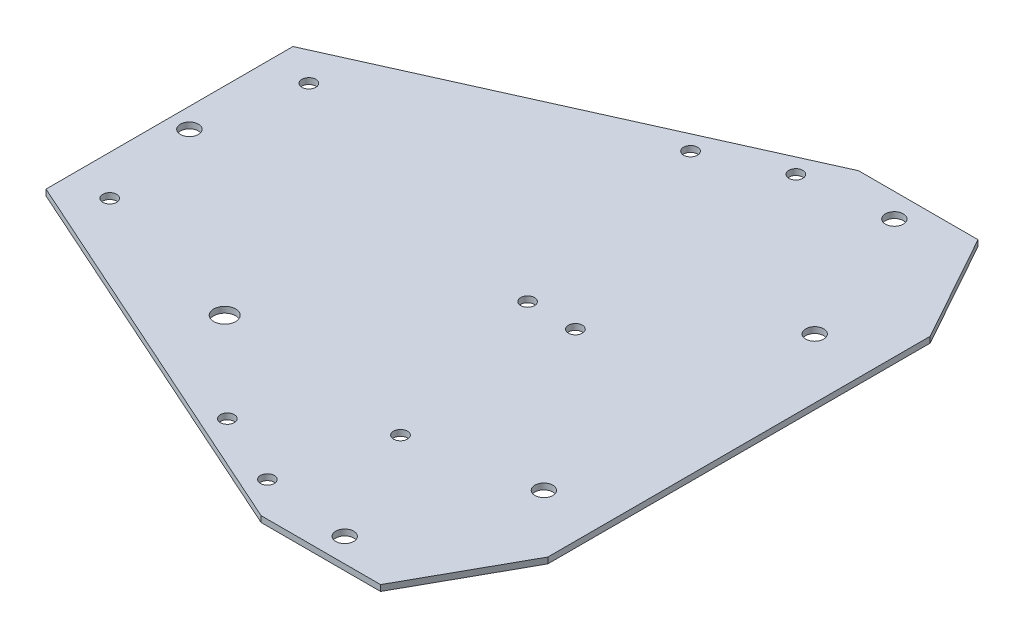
ISO-10303-21;
HEADER;
FILE_DESCRIPTION(('STEP AP214'),'2;1');
FILE_NAME('part.step','',(''),(''),'','','');
FILE_SCHEMA(('AUTOMOTIVE_DESIGN { 1 0 10303 214 1 1 1 1 }'));
ENDSEC;
DATA;
#1=APPLICATION_CONTEXT('core data for automotive mechanical design processes');
#2=APPLICATION_PROTOCOL_DEFINITION('international standard','automotive_design',2000,#1);
#3=PRODUCT_CONTEXT('',#1,'mechanical');
#4=PRODUCT('Part','Part','',(#3));
#5=PRODUCT_RELATED_PRODUCT_CATEGORY('part','',(#4));
#6=PRODUCT_DEFINITION_FORMATION('','',#4);
#7=PRODUCT_DEFINITION_CONTEXT('part definition',#1,'design');
#8=PRODUCT_DEFINITION('design','',#6,#7);
#9=PRODUCT_DEFINITION_SHAPE('','',#8);
#10=(LENGTH_UNIT() NAMED_UNIT(*) SI_UNIT(.MILLI.,.METRE.));
#11=(NAMED_UNIT(*) PLANE_ANGLE_UNIT() SI_UNIT($,.RADIAN.));
#12=(NAMED_UNIT(*) SI_UNIT($,.STERADIAN.) SOLID_ANGLE_UNIT());
#13=UNCERTAINTY_MEASURE_WITH_UNIT(LENGTH_MEASURE(1.E-05),#10,'distance_accuracy_value','');
#14=(GEOMETRIC_REPRESENTATION_CONTEXT(3) GLOBAL_UNCERTAINTY_ASSIGNED_CONTEXT((#13)) GLOBAL_UNIT_ASSIGNED_CONTEXT((#10,
#11,#12)) REPRESENTATION_CONTEXT('',''));
#15=CARTESIAN_POINT('',(0.,0.,0.));
#16=DIRECTION('',(0.,0.,1.));
#17=DIRECTION('',(1.,0.,0.));
#18=AXIS2_PLACEMENT_3D('',#15,#16,#17);
#19=CARTESIAN_POINT('',(0.,-1.5,-31.));
#20=DIRECTION('',(-0.40959040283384,0.,-0.912269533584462));
#21=DIRECTION('',(-0.912269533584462,0.,0.40959040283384));
#22=AXIS2_PLACEMENT_3D('',#19,#20,#21);
#23=PLANE('',#22);
#24=DIRECTION('',(-0.912269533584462,0.,0.40959040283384));
#25=VECTOR('',#24,1.);
#26=CARTESIAN_POINT('',(0.,0.,-31.));
#27=LINE('',#26,#25);
#28=CARTESIAN_POINT('',(98.,0.,-75.));
#29=VERTEX_POINT('',#28);
#30=CARTESIAN_POINT('',(0.,0.,-31.));
#31=VERTEX_POINT('',#30);
#32=EDGE_CURVE('E150',#29,#31,#27,.T.);
#33=ORIENTED_EDGE('',*,*,#32,.F.);
#34=DIRECTION('',(0.,1.,0.));
#35=VECTOR('',#34,1.);
#36=CARTESIAN_POINT('',(98.,-1.5,-75.));
#37=LINE('',#36,#35);
#38=CARTESIAN_POINT('',(98.,-1.5,-75.));
#39=VERTEX_POINT('',#38);
#40=EDGE_CURVE('E13',#39,#29,#37,.T.);
#41=ORIENTED_EDGE('',*,*,#40,.F.);
#42=DIRECTION('',(-0.912269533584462,0.,0.40959040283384));
#43=VECTOR('',#42,1.);
#44=CARTESIAN_POINT('',(0.,-1.5,-31.));
#45=LINE('',#44,#43);
#46=CARTESIAN_POINT('',(0.,-1.5,-31.));
#47=VERTEX_POINT('',#46);
#48=EDGE_CURVE('E171',#39,#47,#45,.T.);
#49=ORIENTED_EDGE('',*,*,#48,.T.);
#50=DIRECTION('',(0.,1.,0.));
#51=VECTOR('',#50,1.);
#52=CARTESIAN_POINT('',(0.,-1.5,-31.));
#53=LINE('',#52,#51);
#54=EDGE_CURVE('E56',#47,#31,#53,.T.);
#55=ORIENTED_EDGE('',*,*,#54,.T.);
#56=EDGE_LOOP('',(#33,#41,#49,#55));
#57=FACE_BOUND('',#56,.T.);
#58=ADVANCED_FACE('F53',(#57),#23,.T.);
#59=CARTESIAN_POINT('',(98.,-1.5,-75.));
#60=DIRECTION('',(0.,0.,-1.));
#61=DIRECTION('',(-1.,0.,0.));
#62=AXIS2_PLACEMENT_3D('',#59,#60,#61);
#63=PLANE('',#62);
#64=DIRECTION('',(-1.,0.,0.));
#65=VECTOR('',#64,1.);
#66=CARTESIAN_POINT('',(98.,0.,-75.));
#67=LINE('',#66,#65);
#68=CARTESIAN_POINT('',(128.,0.,-75.));
#69=VERTEX_POINT('',#68);
#70=EDGE_CURVE('E169',#69,#29,#67,.T.);
#71=ORIENTED_EDGE('',*,*,#70,.F.);
#72=DIRECTION('',(0.,1.,0.));
#73=VECTOR('',#72,1.);
#74=CARTESIAN_POINT('',(128.,-1.5,-75.));
#75=LINE('',#74,#73);
#76=CARTESIAN_POINT('',(128.,-1.5,-75.));
#77=VERTEX_POINT('',#76);
#78=EDGE_CURVE('E62',#77,#69,#75,.T.);
#79=ORIENTED_EDGE('',*,*,#78,.F.);
#80=DIRECTION('',(-1.,0.,0.));
#81=VECTOR('',#80,1.);
#82=CARTESIAN_POINT('',(98.,-1.5,-75.));
#83=LINE('',#82,#81);
#84=EDGE_CURVE('E140',#77,#39,#83,.T.);
#85=ORIENTED_EDGE('',*,*,#84,.T.);
#86=ORIENTED_EDGE('',*,*,#40,.T.);
#87=EDGE_LOOP('',(#71,#79,#85,#86));
#88=FACE_BOUND('',#87,.T.);
#89=ADVANCED_FACE('F183',(#88),#63,.T.);
#90=CARTESIAN_POINT('',(128.,-1.5,-75.));
#91=DIRECTION('',(0.874157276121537,0.,-0.485642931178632));
#92=DIRECTION('',(-0.485642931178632,0.,-0.874157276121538));
#93=AXIS2_PLACEMENT_3D('',#90,#91,#92);
#94=PLANE('',#93);
#95=DIRECTION('',(-0.485642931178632,0.,-0.874157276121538));
#96=VECTOR('',#95,1.);
#97=CARTESIAN_POINT('',(128.,0.,-75.));
#98=LINE('',#97,#96);
#99=CARTESIAN_POINT('',(143.,0.,-48.));
#100=VERTEX_POINT('',#99);
#101=EDGE_CURVE('E127',#100,#69,#98,.T.);
#102=ORIENTED_EDGE('',*,*,#101,.F.);
#103=DIRECTION('',(0.,1.,0.));
#104=VECTOR('',#103,1.);
#105=CARTESIAN_POINT('',(143.,-1.5,-48.));
#106=LINE('',#105,#104);
#107=CARTESIAN_POINT('',(143.,-1.5,-48.));
#108=VERTEX_POINT('',#107);
#109=EDGE_CURVE('E122',#108,#100,#106,.T.);
#110=ORIENTED_EDGE('',*,*,#109,.F.);
#111=DIRECTION('',(-0.485642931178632,0.,-0.874157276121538));
#112=VECTOR('',#111,1.);
#113=CARTESIAN_POINT('',(128.,-1.5,-75.));
#114=LINE('',#113,#112);
#115=EDGE_CURVE('E125',#108,#77,#114,.T.);
#116=ORIENTED_EDGE('',*,*,#115,.T.);
#117=ORIENTED_EDGE('',*,*,#78,.T.);
#118=EDGE_LOOP('',(#102,#110,#116,#117));
#119=FACE_BOUND('',#118,.T.);
#120=ADVANCED_FACE('F124',(#119),#94,.T.);
#121=CARTESIAN_POINT('',(143.,-1.5,-48.));
#122=DIRECTION('',(1.,0.,0.));
#123=DIRECTION('',(0.,0.,-1.));
#124=AXIS2_PLACEMENT_3D('',#121,#122,#123);
#125=PLANE('',#124);
#126=DIRECTION('',(0.,0.,-1.));
#127=VECTOR('',#126,1.);
#128=CARTESIAN_POINT('',(143.,0.,-48.));
#129=LINE('',#128,#127);
#130=CARTESIAN_POINT('',(143.,0.,48.));
#131=VERTEX_POINT('',#130);
#132=EDGE_CURVE('E166',#131,#100,#129,.T.);
#133=ORIENTED_EDGE('',*,*,#132,.F.);
#134=DIRECTION('',(0.,1.,0.));
#135=VECTOR('',#134,1.);
#136=CARTESIAN_POINT('',(143.,-1.5,48.));
#137=LINE('',#136,#135);
#138=CARTESIAN_POINT('',(143.,-1.5,48.));
#139=VERTEX_POINT('',#138);
#140=EDGE_CURVE('E132',#139,#131,#137,.T.);
#141=ORIENTED_EDGE('',*,*,#140,.F.);
#142=DIRECTION('',(0.,0.,-1.));
#143=VECTOR('',#142,1.);
#144=CARTESIAN_POINT('',(143.,-1.5,-48.));
#145=LINE('',#144,#143);
#146=EDGE_CURVE('E138',#139,#108,#145,.T.);
#147=ORIENTED_EDGE('',*,*,#146,.T.);
#148=ORIENTED_EDGE('',*,*,#109,.T.);
#149=EDGE_LOOP('',(#133,#141,#147,#148));
#150=FACE_BOUND('',#149,.T.);
#151=ADVANCED_FACE('F142',(#150),#125,.T.);
#152=CARTESIAN_POINT('',(128.,-1.5,75.));
#153=DIRECTION('',(0.874157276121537,0.,0.485642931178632));
#154=DIRECTION('',(0.485642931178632,0.,-0.874157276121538));
#155=AXIS2_PLACEMENT_3D('',#152,#153,#154);
#156=PLANE('',#155);
#157=DIRECTION('',(0.485642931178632,0.,-0.874157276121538));
#158=VECTOR('',#157,1.);
#159=CARTESIAN_POINT('',(128.,0.,75.));
#160=LINE('',#159,#158);
#161=CARTESIAN_POINT('',(128.,0.,75.));
#162=VERTEX_POINT('',#161);
#163=EDGE_CURVE('E163',#162,#131,#160,.T.);
#164=ORIENTED_EDGE('',*,*,#163,.F.);
#165=DIRECTION('',(0.,1.,0.));
#166=VECTOR('',#165,1.);
#167=CARTESIAN_POINT('',(128.,-1.5,75.));
#168=LINE('',#167,#166);
#169=CARTESIAN_POINT('',(128.,-1.5,75.));
#170=VERTEX_POINT('',#169);
#171=EDGE_CURVE('E175',#170,#162,#168,.T.);
#172=ORIENTED_EDGE('',*,*,#171,.F.);
#173=DIRECTION('',(0.485642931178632,0.,-0.874157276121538));
#174=VECTOR('',#173,1.);
#175=CARTESIAN_POINT('',(128.,-1.5,75.));
#176=LINE('',#175,#174);
#177=EDGE_CURVE('E143',#170,#139,#176,.T.);
#178=ORIENTED_EDGE('',*,*,#177,.T.);
#179=ORIENTED_EDGE('',*,*,#140,.T.);
#180=EDGE_LOOP('',(#164,#172,#178,#179));
#181=FACE_BOUND('',#180,.T.);
#182=ADVANCED_FACE('F196',(#181),#156,.T.);
#183=CARTESIAN_POINT('',(98.,-1.5,75.));
#184=DIRECTION('',(0.,0.,1.));
#185=DIRECTION('',(1.,0.,0.));
#186=AXIS2_PLACEMENT_3D('',#183,#184,#185);
#187=PLANE('',#186);
#188=DIRECTION('',(1.,0.,0.));
#189=VECTOR('',#188,1.);
#190=CARTESIAN_POINT('',(98.,0.,75.));
#191=LINE('',#190,#189);
#192=CARTESIAN_POINT('',(98.,0.,75.));
#193=VERTEX_POINT('',#192);
#194=EDGE_CURVE('E160',#193,#162,#191,.T.);
#195=ORIENTED_EDGE('',*,*,#194,.F.);
#196=DIRECTION('',(0.,1.,0.));
#197=VECTOR('',#196,1.);
#198=CARTESIAN_POINT('',(98.,-1.5,75.));
#199=LINE('',#198,#197);
#200=CARTESIAN_POINT('',(98.,-1.5,75.));
#201=VERTEX_POINT('',#200);
#202=EDGE_CURVE('E177',#201,#193,#199,.T.);
#203=ORIENTED_EDGE('',*,*,#202,.F.);
#204=DIRECTION('',(1.,0.,0.));
#205=VECTOR('',#204,1.);
#206=CARTESIAN_POINT('',(98.,-1.5,75.));
#207=LINE('',#206,#205);
#208=EDGE_CURVE('E145',#201,#170,#207,.T.);
#209=ORIENTED_EDGE('',*,*,#208,.T.);
#210=ORIENTED_EDGE('',*,*,#171,.T.);
#211=EDGE_LOOP('',(#195,#203,#209,#210));
#212=FACE_BOUND('',#211,.T.);
#213=ADVANCED_FACE('F199',(#212),#187,.T.);
#214=CARTESIAN_POINT('',(0.,-1.5,31.));
#215=DIRECTION('',(-0.40959040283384,0.,0.912269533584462));
#216=DIRECTION('',(0.912269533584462,0.,0.40959040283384));
#217=AXIS2_PLACEMENT_3D('',#214,#215,#216);
#218=PLANE('',#217);
#219=DIRECTION('',(0.912269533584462,0.,0.40959040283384));
#220=VECTOR('',#219,1.);
#221=CARTESIAN_POINT('',(0.,0.,31.));
#222=LINE('',#221,#220);
#223=CARTESIAN_POINT('',(0.,0.,31.));
#224=VERTEX_POINT('',#223);
#225=EDGE_CURVE('E157',#224,#193,#222,.T.);
#226=ORIENTED_EDGE('',*,*,#225,.F.);
#227=DIRECTION('',(0.,1.,0.));
#228=VECTOR('',#227,1.);
#229=CARTESIAN_POINT('',(0.,-1.5,31.));
#230=LINE('',#229,#228);
#231=CARTESIAN_POINT('',(0.,-1.5,31.));
#232=VERTEX_POINT('',#231);
#233=EDGE_CURVE('E178',#232,#224,#230,.T.);
#234=ORIENTED_EDGE('',*,*,#233,.F.);
#235=DIRECTION('',(0.912269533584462,0.,0.40959040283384));
#236=VECTOR('',#235,1.);
#237=CARTESIAN_POINT('',(0.,-1.5,31.));
#238=LINE('',#237,#236);
#239=EDGE_CURVE('E375',#232,#201,#238,.T.);
#240=ORIENTED_EDGE('',*,*,#239,.T.);
#241=ORIENTED_EDGE('',*,*,#202,.T.);
#242=EDGE_LOOP('',(#226,#234,#240,#241));
#243=FACE_BOUND('',#242,.T.);
#244=ADVANCED_FACE('F203',(#243),#218,.T.);
#245=CARTESIAN_POINT('',(0.,-1.5,31.));
#246=DIRECTION('',(-1.,0.,0.));
#247=DIRECTION('',(0.,0.,1.));
#248=AXIS2_PLACEMENT_3D('',#245,#246,#247);
#249=PLANE('',#248);
#250=DIRECTION('',(0.,0.,1.));
#251=VECTOR('',#250,1.);
#252=CARTESIAN_POINT('',(0.,0.,31.));
#253=LINE('',#252,#251);
#254=EDGE_CURVE('E153',#31,#224,#253,.T.);
#255=ORIENTED_EDGE('',*,*,#254,.F.);
#256=ORIENTED_EDGE('',*,*,#54,.F.);
#257=DIRECTION('',(0.,0.,1.));
#258=VECTOR('',#257,1.);
#259=CARTESIAN_POINT('',(0.,-1.5,31.));
#260=LINE('',#259,#258);
#261=EDGE_CURVE('E373',#47,#232,#260,.T.);
#262=ORIENTED_EDGE('',*,*,#261,.T.);
#263=ORIENTED_EDGE('',*,*,#233,.T.);
#264=EDGE_LOOP('',(#255,#256,#262,#263));
#265=FACE_BOUND('',#264,.T.);
#266=ADVANCED_FACE('F180',(#265),#249,.T.);
#267=CARTESIAN_POINT('',(0.,-1.5,0.));
#268=DIRECTION('',(0.,-1.,0.));
#269=DIRECTION('',(0.,0.,-1.));
#270=AXIS2_PLACEMENT_3D('',#267,#268,#269);
#271=PLANE('',#270);
#272=CARTESIAN_POINT('',(96.92,-1.5,-5.));
#273=DIRECTION('',(0.,1.,0.));
#274=DIRECTION('',(0.,0.,1.));
#275=AXIS2_PLACEMENT_3D('',#272,#273,#274);
#276=CIRCLE('',#275,1.75);
#277=CARTESIAN_POINT('',(96.92,-1.5,-3.25));
#278=VERTEX_POINT('',#277);
#279=EDGE_CURVE('E282',#278,#278,#276,.T.);
#280=ORIENTED_EDGE('',*,*,#279,.T.);
#281=EDGE_LOOP('',(#280));
#282=FACE_BOUND('',#281,.T.);
#283=CARTESIAN_POINT('',(84.92,-1.5,-5.));
#284=DIRECTION('',(0.,1.,0.));
#285=DIRECTION('',(0.,0.,1.));
#286=AXIS2_PLACEMENT_3D('',#283,#284,#285);
#287=CIRCLE('',#286,1.75);
#288=CARTESIAN_POINT('',(84.92,-1.5,-3.25));
#289=VERTEX_POINT('',#288);
#290=EDGE_CURVE('E290',#289,#289,#287,.T.);
#291=ORIENTED_EDGE('',*,*,#290,.T.);
#292=EDGE_LOOP('',(#291));
#293=FACE_BOUND('',#292,.T.);
#294=CARTESIAN_POINT('',(98.,-1.5,40.));
#295=DIRECTION('',(0.,1.,0.));
#296=DIRECTION('',(0.,0.,1.));
#297=AXIS2_PLACEMENT_3D('',#294,#295,#296);
#298=CIRCLE('',#297,1.75);
#299=CARTESIAN_POINT('',(98.,-1.5,41.75));
#300=VERTEX_POINT('',#299);
#301=EDGE_CURVE('E296',#300,#300,#298,.T.);
#302=ORIENTED_EDGE('',*,*,#301,.T.);
#303=EDGE_LOOP('',(#302));
#304=FACE_BOUND('',#303,.T.);
#305=CARTESIAN_POINT('',(49.8636363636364,-1.5,36.));
#306=DIRECTION('',(0.,1.,0.));
#307=DIRECTION('',(0.,0.,1.));
#308=AXIS2_PLACEMENT_3D('',#305,#306,#307);
#309=CIRCLE('',#308,2.75);
#310=CARTESIAN_POINT('',(49.8636363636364,-1.5,38.75));
#311=VERTEX_POINT('',#310);
#312=EDGE_CURVE('E302',#311,#311,#309,.T.);
#313=ORIENTED_EDGE('',*,*,#312,.T.);
#314=EDGE_LOOP('',(#313));
#315=FACE_BOUND('',#314,.T.);
#316=CARTESIAN_POINT('',(10.,-1.5,25.));
#317=DIRECTION('',(0.,1.,0.));
#318=DIRECTION('',(0.,0.,-1.));
#319=AXIS2_PLACEMENT_3D('',#316,#317,#318);
#320=CIRCLE('',#319,1.75);
#321=CARTESIAN_POINT('',(10.,-1.5,23.25));
#322=VERTEX_POINT('',#321);
#323=EDGE_CURVE('E308',#322,#322,#320,.T.);
#324=ORIENTED_EDGE('',*,*,#323,.T.);
#325=EDGE_LOOP('',(#324));
#326=FACE_BOUND('',#325,.T.);
#327=CARTESIAN_POINT('',(128.,-1.5,34.));
#328=DIRECTION('',(0.,1.,0.));
#329=DIRECTION('',(0.,0.,-1.));
#330=AXIS2_PLACEMENT_3D('',#327,#328,#329);
#331=CIRCLE('',#330,2.25000000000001);
#332=CARTESIAN_POINT('',(128.,-1.5,31.75));
#333=VERTEX_POINT('',#332);
#334=EDGE_CURVE('E314',#333,#333,#331,.T.);
#335=ORIENTED_EDGE('',*,*,#334,.T.);
#336=EDGE_LOOP('',(#335));
#337=FACE_BOUND('',#336,.T.);
#338=CARTESIAN_POINT('',(113.,-1.5,69.));
#339=DIRECTION('',(0.,1.,0.));
#340=DIRECTION('',(0.,0.,-1.));
#341=AXIS2_PLACEMENT_3D('',#338,#339,#340);
#342=CIRCLE('',#341,2.25);
#343=CARTESIAN_POINT('',(113.,-1.5,66.75));
#344=VERTEX_POINT('',#343);
#345=EDGE_CURVE('E320',#344,#344,#342,.T.);
#346=ORIENTED_EDGE('',*,*,#345,.T.);
#347=EDGE_LOOP('',(#346));
#348=FACE_BOUND('',#347,.T.);
#349=CARTESIAN_POINT('',(90.9252566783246,-1.5,66.3427483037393));
#350=DIRECTION('',(0.,1.,0.));
#351=DIRECTION('',(0.,0.,-1.));
#352=AXIS2_PLACEMENT_3D('',#349,#350,#351);
#353=CIRCLE('',#352,1.75);
#354=CARTESIAN_POINT('',(90.9252566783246,-1.5,64.5927483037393));
#355=VERTEX_POINT('',#354);
#356=EDGE_CURVE('E326',#355,#355,#353,.T.);
#357=ORIENTED_EDGE('',*,*,#356,.T.);
#358=EDGE_LOOP('',(#357));
#359=FACE_BOUND('',#358,.T.);
#360=CARTESIAN_POINT('',(72.6798660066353,-1.5,58.1509402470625));
#361=DIRECTION('',(0.,1.,0.));
#362=DIRECTION('',(0.,0.,-1.));
#363=AXIS2_PLACEMENT_3D('',#360,#361,#362);
#364=CIRCLE('',#363,1.75);
#365=CARTESIAN_POINT('',(72.6798660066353,-1.5,56.4009402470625));
#366=VERTEX_POINT('',#365);
#367=EDGE_CURVE('E332',#366,#366,#364,.T.);
#368=ORIENTED_EDGE('',*,*,#367,.T.);
#369=EDGE_LOOP('',(#368));
#370=FACE_BOUND('',#369,.T.);
#371=CARTESIAN_POINT('',(90.9252566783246,-1.5,-66.3427483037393));
#372=DIRECTION('',(0.,1.,0.));
#373=DIRECTION('',(0.,0.,1.));
#374=AXIS2_PLACEMENT_3D('',#371,#372,#373);
#375=CIRCLE('',#374,1.75);
#376=CARTESIAN_POINT('',(90.9252566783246,-1.5,-64.5927483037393));
#377=VERTEX_POINT('',#376);
#378=EDGE_CURVE('E338',#377,#377,#375,.T.);
#379=ORIENTED_EDGE('',*,*,#378,.T.);
#380=EDGE_LOOP('',(#379));
#381=FACE_BOUND('',#380,.T.);
#382=CARTESIAN_POINT('',(72.6798660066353,-1.5,-58.1509402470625));
#383=DIRECTION('',(0.,1.,0.));
#384=DIRECTION('',(0.,0.,1.));
#385=AXIS2_PLACEMENT_3D('',#382,#383,#384);
#386=CIRCLE('',#385,1.75);
#387=CARTESIAN_POINT('',(72.6798660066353,-1.5,-56.4009402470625));
#388=VERTEX_POINT('',#387);
#389=EDGE_CURVE('E344',#388,#388,#386,.T.);
#390=ORIENTED_EDGE('',*,*,#389,.T.);
#391=EDGE_LOOP('',(#390));
#392=FACE_BOUND('',#391,.T.);
#393=CARTESIAN_POINT('',(128.,-1.5,-34.));
#394=DIRECTION('',(0.,1.,0.));
#395=DIRECTION('',(0.,0.,1.));
#396=AXIS2_PLACEMENT_3D('',#393,#394,#395);
#397=CIRCLE('',#396,2.25000000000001);
#398=CARTESIAN_POINT('',(128.,-1.5,-31.75));
#399=VERTEX_POINT('',#398);
#400=EDGE_CURVE('E350',#399,#399,#397,.T.);
#401=ORIENTED_EDGE('',*,*,#400,.T.);
#402=EDGE_LOOP('',(#401));
#403=FACE_BOUND('',#402,.T.);
#404=CARTESIAN_POINT('',(113.,-1.5,-69.));
#405=DIRECTION('',(0.,1.,0.));
#406=DIRECTION('',(0.,0.,1.));
#407=AXIS2_PLACEMENT_3D('',#404,#405,#406);
#408=CIRCLE('',#407,2.25);
#409=CARTESIAN_POINT('',(113.,-1.5,-66.75));
#410=VERTEX_POINT('',#409);
#411=EDGE_CURVE('E356',#410,#410,#408,.T.);
#412=ORIENTED_EDGE('',*,*,#411,.T.);
#413=EDGE_LOOP('',(#412));
#414=FACE_BOUND('',#413,.T.);
#415=CARTESIAN_POINT('',(10.,-1.5,-25.));
#416=DIRECTION('',(0.,1.,0.));
#417=DIRECTION('',(0.,0.,1.));
#418=AXIS2_PLACEMENT_3D('',#415,#416,#417);
#419=CIRCLE('',#418,1.75);
#420=CARTESIAN_POINT('',(10.,-1.5,-23.25));
#421=VERTEX_POINT('',#420);
#422=EDGE_CURVE('E362',#421,#421,#419,.T.);
#423=ORIENTED_EDGE('',*,*,#422,.T.);
#424=EDGE_LOOP('',(#423));
#425=FACE_BOUND('',#424,.T.);
#426=CARTESIAN_POINT('',(5.,-1.5,0.));
#427=DIRECTION('',(0.,1.,0.));
#428=DIRECTION('',(0.,0.,1.));
#429=AXIS2_PLACEMENT_3D('',#426,#427,#428);
#430=CIRCLE('',#429,2.25);
#431=CARTESIAN_POINT('',(5.,-1.5,2.25));
#432=VERTEX_POINT('',#431);
#433=EDGE_CURVE('E154',#432,#432,#430,.T.);
#434=ORIENTED_EDGE('',*,*,#433,.T.);
#435=EDGE_LOOP('',(#434));
#436=FACE_BOUND('',#435,.T.);
#437=ORIENTED_EDGE('',*,*,#48,.F.);
#438=ORIENTED_EDGE('',*,*,#84,.F.);
#439=ORIENTED_EDGE('',*,*,#115,.F.);
#440=ORIENTED_EDGE('',*,*,#146,.F.);
#441=ORIENTED_EDGE('',*,*,#177,.F.);
#442=ORIENTED_EDGE('',*,*,#208,.F.);
#443=ORIENTED_EDGE('',*,*,#239,.F.);
#444=ORIENTED_EDGE('',*,*,#261,.F.);
#445=EDGE_LOOP('',(#437,#438,#439,#440,#441,#442,#443,#444));
#446=FACE_BOUND('',#445,.T.);
#447=ADVANCED_FACE('F136',(#282,#293,#304,#315,#326,#337,#348,#359,#370,#381,#392,#403,#414,
#425,#436,#446),#271,.T.);
#448=CARTESIAN_POINT('',(0.,0.,0.));
#449=DIRECTION('',(0.,-1.,0.));
#450=DIRECTION('',(0.,0.,-1.));
#451=AXIS2_PLACEMENT_3D('',#448,#449,#450);
#452=PLANE('',#451);
#453=CARTESIAN_POINT('',(96.92,0.,-5.));
#454=DIRECTION('',(0.,1.,0.));
#455=DIRECTION('',(0.,0.,1.));
#456=AXIS2_PLACEMENT_3D('',#453,#454,#455);
#457=CIRCLE('',#456,1.75);
#458=CARTESIAN_POINT('',(96.92,0.,-3.25));
#459=VERTEX_POINT('',#458);
#460=EDGE_CURVE('E285',#459,#459,#457,.T.);
#461=ORIENTED_EDGE('',*,*,#460,.F.);
#462=EDGE_LOOP('',(#461));
#463=FACE_BOUND('',#462,.T.);
#464=CARTESIAN_POINT('',(84.92,0.,-5.));
#465=DIRECTION('',(0.,1.,0.));
#466=DIRECTION('',(0.,0.,1.));
#467=AXIS2_PLACEMENT_3D('',#464,#465,#466);
#468=CIRCLE('',#467,1.75);
#469=CARTESIAN_POINT('',(84.92,0.,-3.25));
#470=VERTEX_POINT('',#469);
#471=EDGE_CURVE('E287',#470,#470,#468,.T.);
#472=ORIENTED_EDGE('',*,*,#471,.F.);
#473=EDGE_LOOP('',(#472));
#474=FACE_BOUND('',#473,.T.);
#475=CARTESIAN_POINT('',(98.,0.,40.));
#476=DIRECTION('',(0.,1.,0.));
#477=DIRECTION('',(0.,0.,1.));
#478=AXIS2_PLACEMENT_3D('',#475,#476,#477);
#479=CIRCLE('',#478,1.75);
#480=CARTESIAN_POINT('',(98.,0.,41.75));
#481=VERTEX_POINT('',#480);
#482=EDGE_CURVE('E293',#481,#481,#479,.T.);
#483=ORIENTED_EDGE('',*,*,#482,.F.);
#484=EDGE_LOOP('',(#483));
#485=FACE_BOUND('',#484,.T.);
#486=CARTESIAN_POINT('',(49.8636363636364,0.,36.));
#487=DIRECTION('',(0.,1.,0.));
#488=DIRECTION('',(0.,0.,1.));
#489=AXIS2_PLACEMENT_3D('',#486,#487,#488);
#490=CIRCLE('',#489,2.75);
#491=CARTESIAN_POINT('',(49.8636363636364,0.,38.75));
#492=VERTEX_POINT('',#491);
#493=EDGE_CURVE('E299',#492,#492,#490,.T.);
#494=ORIENTED_EDGE('',*,*,#493,.F.);
#495=EDGE_LOOP('',(#494));
#496=FACE_BOUND('',#495,.T.);
#497=CARTESIAN_POINT('',(10.,0.,25.));
#498=DIRECTION('',(0.,1.,0.));
#499=DIRECTION('',(0.,0.,-1.));
#500=AXIS2_PLACEMENT_3D('',#497,#498,#499);
#501=CIRCLE('',#500,1.75);
#502=CARTESIAN_POINT('',(10.,0.,23.25));
#503=VERTEX_POINT('',#502);
#504=EDGE_CURVE('E305',#503,#503,#501,.T.);
#505=ORIENTED_EDGE('',*,*,#504,.F.);
#506=EDGE_LOOP('',(#505));
#507=FACE_BOUND('',#506,.T.);
#508=CARTESIAN_POINT('',(128.,0.,34.));
#509=DIRECTION('',(0.,1.,0.));
#510=DIRECTION('',(0.,0.,-1.));
#511=AXIS2_PLACEMENT_3D('',#508,#509,#510);
#512=CIRCLE('',#511,2.25000000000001);
#513=CARTESIAN_POINT('',(128.,0.,31.75));
#514=VERTEX_POINT('',#513);
#515=EDGE_CURVE('E311',#514,#514,#512,.T.);
#516=ORIENTED_EDGE('',*,*,#515,.F.);
#517=EDGE_LOOP('',(#516));
#518=FACE_BOUND('',#517,.T.);
#519=CARTESIAN_POINT('',(113.,0.,69.));
#520=DIRECTION('',(0.,1.,0.));
#521=DIRECTION('',(0.,0.,-1.));
#522=AXIS2_PLACEMENT_3D('',#519,#520,#521);
#523=CIRCLE('',#522,2.25);
#524=CARTESIAN_POINT('',(113.,0.,66.75));
#525=VERTEX_POINT('',#524);
#526=EDGE_CURVE('E317',#525,#525,#523,.T.);
#527=ORIENTED_EDGE('',*,*,#526,.F.);
#528=EDGE_LOOP('',(#527));
#529=FACE_BOUND('',#528,.T.);
#530=CARTESIAN_POINT('',(90.9252566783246,0.,66.3427483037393));
#531=DIRECTION('',(0.,1.,0.));
#532=DIRECTION('',(0.,0.,-1.));
#533=AXIS2_PLACEMENT_3D('',#530,#531,#532);
#534=CIRCLE('',#533,1.75);
#535=CARTESIAN_POINT('',(90.9252566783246,0.,64.5927483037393));
#536=VERTEX_POINT('',#535);
#537=EDGE_CURVE('E323',#536,#536,#534,.T.);
#538=ORIENTED_EDGE('',*,*,#537,.F.);
#539=EDGE_LOOP('',(#538));
#540=FACE_BOUND('',#539,.T.);
#541=CARTESIAN_POINT('',(72.6798660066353,0.,58.1509402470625));
#542=DIRECTION('',(0.,1.,0.));
#543=DIRECTION('',(0.,0.,-1.));
#544=AXIS2_PLACEMENT_3D('',#541,#542,#543);
#545=CIRCLE('',#544,1.75);
#546=CARTESIAN_POINT('',(72.6798660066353,0.,56.4009402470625));
#547=VERTEX_POINT('',#546);
#548=EDGE_CURVE('E329',#547,#547,#545,.T.);
#549=ORIENTED_EDGE('',*,*,#548,.F.);
#550=EDGE_LOOP('',(#549));
#551=FACE_BOUND('',#550,.T.);
#552=CARTESIAN_POINT('',(90.9252566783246,0.,-66.3427483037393));
#553=DIRECTION('',(0.,1.,0.));
#554=DIRECTION('',(0.,0.,1.));
#555=AXIS2_PLACEMENT_3D('',#552,#553,#554);
#556=CIRCLE('',#555,1.75);
#557=CARTESIAN_POINT('',(90.9252566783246,0.,-64.5927483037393));
#558=VERTEX_POINT('',#557);
#559=EDGE_CURVE('E335',#558,#558,#556,.T.);
#560=ORIENTED_EDGE('',*,*,#559,.F.);
#561=EDGE_LOOP('',(#560));
#562=FACE_BOUND('',#561,.T.);
#563=CARTESIAN_POINT('',(72.6798660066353,0.,-58.1509402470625));
#564=DIRECTION('',(0.,1.,0.));
#565=DIRECTION('',(0.,0.,1.));
#566=AXIS2_PLACEMENT_3D('',#563,#564,#565);
#567=CIRCLE('',#566,1.75);
#568=CARTESIAN_POINT('',(72.6798660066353,0.,-56.4009402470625));
#569=VERTEX_POINT('',#568);
#570=EDGE_CURVE('E341',#569,#569,#567,.T.);
#571=ORIENTED_EDGE('',*,*,#570,.F.);
#572=EDGE_LOOP('',(#571));
#573=FACE_BOUND('',#572,.T.);
#574=CARTESIAN_POINT('',(128.,0.,-34.));
#575=DIRECTION('',(0.,1.,0.));
#576=DIRECTION('',(0.,0.,1.));
#577=AXIS2_PLACEMENT_3D('',#574,#575,#576);
#578=CIRCLE('',#577,2.25000000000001);
#579=CARTESIAN_POINT('',(128.,0.,-31.75));
#580=VERTEX_POINT('',#579);
#581=EDGE_CURVE('E347',#580,#580,#578,.T.);
#582=ORIENTED_EDGE('',*,*,#581,.F.);
#583=EDGE_LOOP('',(#582));
#584=FACE_BOUND('',#583,.T.);
#585=CARTESIAN_POINT('',(113.,0.,-69.));
#586=DIRECTION('',(0.,1.,0.));
#587=DIRECTION('',(0.,0.,1.));
#588=AXIS2_PLACEMENT_3D('',#585,#586,#587);
#589=CIRCLE('',#588,2.25);
#590=CARTESIAN_POINT('',(113.,0.,-66.75));
#591=VERTEX_POINT('',#590);
#592=EDGE_CURVE('E353',#591,#591,#589,.T.);
#593=ORIENTED_EDGE('',*,*,#592,.F.);
#594=EDGE_LOOP('',(#593));
#595=FACE_BOUND('',#594,.T.);
#596=CARTESIAN_POINT('',(10.,0.,-25.));
#597=DIRECTION('',(0.,1.,0.));
#598=DIRECTION('',(0.,0.,1.));
#599=AXIS2_PLACEMENT_3D('',#596,#597,#598);
#600=CIRCLE('',#599,1.75);
#601=CARTESIAN_POINT('',(10.,0.,-23.25));
#602=VERTEX_POINT('',#601);
#603=EDGE_CURVE('E359',#602,#602,#600,.T.);
#604=ORIENTED_EDGE('',*,*,#603,.F.);
#605=EDGE_LOOP('',(#604));
#606=FACE_BOUND('',#605,.T.);
#607=CARTESIAN_POINT('',(5.,0.,0.));
#608=DIRECTION('',(0.,1.,0.));
#609=DIRECTION('',(0.,0.,1.));
#610=AXIS2_PLACEMENT_3D('',#607,#608,#609);
#611=CIRCLE('',#610,2.25);
#612=CARTESIAN_POINT('',(5.,0.,2.25));
#613=VERTEX_POINT('',#612);
#614=EDGE_CURVE('E365',#613,#613,#611,.T.);
#615=ORIENTED_EDGE('',*,*,#614,.F.);
#616=EDGE_LOOP('',(#615));
#617=FACE_BOUND('',#616,.T.);
#618=ORIENTED_EDGE('',*,*,#32,.T.);
#619=ORIENTED_EDGE('',*,*,#254,.T.);
#620=ORIENTED_EDGE('',*,*,#225,.T.);
#621=ORIENTED_EDGE('',*,*,#194,.T.);
#622=ORIENTED_EDGE('',*,*,#163,.T.);
#623=ORIENTED_EDGE('',*,*,#132,.T.);
#624=ORIENTED_EDGE('',*,*,#101,.T.);
#625=ORIENTED_EDGE('',*,*,#70,.T.);
#626=EDGE_LOOP('',(#618,#619,#620,#621,#622,#623,#624,#625));
#627=FACE_BOUND('',#626,.T.);
#628=ADVANCED_FACE('F182',(#463,#474,#485,#496,#507,#518,#529,#540,#551,#562,#573,#584,#595,
#606,#617,#627),#452,.F.);
#629=CARTESIAN_POINT('',(5.,-1.5,0.));
#630=DIRECTION('',(0.,1.,0.));
#631=DIRECTION('',(0.,0.,1.));
#632=AXIS2_PLACEMENT_3D('',#629,#630,#631);
#633=CYLINDRICAL_SURFACE('',#632,2.25);
#634=ORIENTED_EDGE('',*,*,#433,.F.);
#635=EDGE_LOOP('',(#634));
#636=FACE_BOUND('',#635,.T.);
#637=ORIENTED_EDGE('',*,*,#614,.T.);
#638=EDGE_LOOP('',(#637));
#639=FACE_BOUND('',#638,.T.);
#640=ADVANCED_FACE('F215',(#636,#639),#633,.F.);
#641=CARTESIAN_POINT('',(10.,-1.5,-25.));
#642=DIRECTION('',(0.,1.,0.));
#643=DIRECTION('',(0.,0.,1.));
#644=AXIS2_PLACEMENT_3D('',#641,#642,#643);
#645=CYLINDRICAL_SURFACE('',#644,1.75);
#646=ORIENTED_EDGE('',*,*,#422,.F.);
#647=EDGE_LOOP('',(#646));
#648=FACE_BOUND('',#647,.T.);
#649=ORIENTED_EDGE('',*,*,#603,.T.);
#650=EDGE_LOOP('',(#649));
#651=FACE_BOUND('',#650,.T.);
#652=ADVANCED_FACE('F222',(#648,#651),#645,.F.);
#653=CARTESIAN_POINT('',(113.,-1.5,-69.));
#654=DIRECTION('',(0.,1.,0.));
#655=DIRECTION('',(0.,0.,1.));
#656=AXIS2_PLACEMENT_3D('',#653,#654,#655);
#657=CYLINDRICAL_SURFACE('',#656,2.25);
#658=ORIENTED_EDGE('',*,*,#411,.F.);
#659=EDGE_LOOP('',(#658));
#660=FACE_BOUND('',#659,.T.);
#661=ORIENTED_EDGE('',*,*,#592,.T.);
#662=EDGE_LOOP('',(#661));
#663=FACE_BOUND('',#662,.T.);
#664=ADVANCED_FACE('F226',(#660,#663),#657,.F.);
#665=CARTESIAN_POINT('',(128.,-1.5,-34.));
#666=DIRECTION('',(0.,1.,0.));
#667=DIRECTION('',(0.,0.,1.));
#668=AXIS2_PLACEMENT_3D('',#665,#666,#667);
#669=CYLINDRICAL_SURFACE('',#668,2.25000000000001);
#670=ORIENTED_EDGE('',*,*,#400,.F.);
#671=EDGE_LOOP('',(#670));
#672=FACE_BOUND('',#671,.T.);
#673=ORIENTED_EDGE('',*,*,#581,.T.);
#674=EDGE_LOOP('',(#673));
#675=FACE_BOUND('',#674,.T.);
#676=ADVANCED_FACE('F230',(#672,#675),#669,.F.);
#677=CARTESIAN_POINT('',(72.6798660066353,-1.5,-58.1509402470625));
#678=DIRECTION('',(0.,1.,0.));
#679=DIRECTION('',(0.,0.,1.));
#680=AXIS2_PLACEMENT_3D('',#677,#678,#679);
#681=CYLINDRICAL_SURFACE('',#680,1.75);
#682=ORIENTED_EDGE('',*,*,#389,.F.);
#683=EDGE_LOOP('',(#682));
#684=FACE_BOUND('',#683,.T.);
#685=ORIENTED_EDGE('',*,*,#570,.T.);
#686=EDGE_LOOP('',(#685));
#687=FACE_BOUND('',#686,.T.);
#688=ADVANCED_FACE('F234',(#684,#687),#681,.F.);
#689=CARTESIAN_POINT('',(90.9252566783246,-1.5,-66.3427483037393));
#690=DIRECTION('',(0.,1.,0.));
#691=DIRECTION('',(0.,0.,1.));
#692=AXIS2_PLACEMENT_3D('',#689,#690,#691);
#693=CYLINDRICAL_SURFACE('',#692,1.75);
#694=ORIENTED_EDGE('',*,*,#378,.F.);
#695=EDGE_LOOP('',(#694));
#696=FACE_BOUND('',#695,.T.);
#697=ORIENTED_EDGE('',*,*,#559,.T.);
#698=EDGE_LOOP('',(#697));
#699=FACE_BOUND('',#698,.T.);
#700=ADVANCED_FACE('F238',(#696,#699),#693,.F.);
#701=CARTESIAN_POINT('',(72.6798660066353,-1.5,58.1509402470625));
#702=DIRECTION('',(0.,1.,0.));
#703=DIRECTION('',(0.,0.,1.));
#704=AXIS2_PLACEMENT_3D('',#701,#702,#703);
#705=CYLINDRICAL_SURFACE('',#704,1.75);
#706=ORIENTED_EDGE('',*,*,#367,.F.);
#707=EDGE_LOOP('',(#706));
#708=FACE_BOUND('',#707,.T.);
#709=ORIENTED_EDGE('',*,*,#548,.T.);
#710=EDGE_LOOP('',(#709));
#711=FACE_BOUND('',#710,.T.);
#712=ADVANCED_FACE('F242',(#708,#711),#705,.F.);
#713=CARTESIAN_POINT('',(90.9252566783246,-1.5,66.3427483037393));
#714=DIRECTION('',(0.,1.,0.));
#715=DIRECTION('',(0.,0.,1.));
#716=AXIS2_PLACEMENT_3D('',#713,#714,#715);
#717=CYLINDRICAL_SURFACE('',#716,1.75);
#718=ORIENTED_EDGE('',*,*,#356,.F.);
#719=EDGE_LOOP('',(#718));
#720=FACE_BOUND('',#719,.T.);
#721=ORIENTED_EDGE('',*,*,#537,.T.);
#722=EDGE_LOOP('',(#721));
#723=FACE_BOUND('',#722,.T.);
#724=ADVANCED_FACE('F246',(#720,#723),#717,.F.);
#725=CARTESIAN_POINT('',(113.,-1.5,69.));
#726=DIRECTION('',(0.,1.,0.));
#727=DIRECTION('',(0.,0.,1.));
#728=AXIS2_PLACEMENT_3D('',#725,#726,#727);
#729=CYLINDRICAL_SURFACE('',#728,2.25);
#730=ORIENTED_EDGE('',*,*,#345,.F.);
#731=EDGE_LOOP('',(#730));
#732=FACE_BOUND('',#731,.T.);
#733=ORIENTED_EDGE('',*,*,#526,.T.);
#734=EDGE_LOOP('',(#733));
#735=FACE_BOUND('',#734,.T.);
#736=ADVANCED_FACE('F250',(#732,#735),#729,.F.);
#737=CARTESIAN_POINT('',(128.,-1.5,34.));
#738=DIRECTION('',(0.,1.,0.));
#739=DIRECTION('',(0.,0.,1.));
#740=AXIS2_PLACEMENT_3D('',#737,#738,#739);
#741=CYLINDRICAL_SURFACE('',#740,2.25000000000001);
#742=ORIENTED_EDGE('',*,*,#334,.F.);
#743=EDGE_LOOP('',(#742));
#744=FACE_BOUND('',#743,.T.);
#745=ORIENTED_EDGE('',*,*,#515,.T.);
#746=EDGE_LOOP('',(#745));
#747=FACE_BOUND('',#746,.T.);
#748=ADVANCED_FACE('F254',(#744,#747),#741,.F.);
#749=CARTESIAN_POINT('',(10.,-1.5,25.));
#750=DIRECTION('',(0.,1.,0.));
#751=DIRECTION('',(0.,0.,1.));
#752=AXIS2_PLACEMENT_3D('',#749,#750,#751);
#753=CYLINDRICAL_SURFACE('',#752,1.75);
#754=ORIENTED_EDGE('',*,*,#323,.F.);
#755=EDGE_LOOP('',(#754));
#756=FACE_BOUND('',#755,.T.);
#757=ORIENTED_EDGE('',*,*,#504,.T.);
#758=EDGE_LOOP('',(#757));
#759=FACE_BOUND('',#758,.T.);
#760=ADVANCED_FACE('F258',(#756,#759),#753,.F.);
#761=CARTESIAN_POINT('',(49.8636363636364,-1.5,36.));
#762=DIRECTION('',(0.,1.,0.));
#763=DIRECTION('',(0.,0.,1.));
#764=AXIS2_PLACEMENT_3D('',#761,#762,#763);
#765=CYLINDRICAL_SURFACE('',#764,2.75);
#766=ORIENTED_EDGE('',*,*,#312,.F.);
#767=EDGE_LOOP('',(#766));
#768=FACE_BOUND('',#767,.T.);
#769=ORIENTED_EDGE('',*,*,#493,.T.);
#770=EDGE_LOOP('',(#769));
#771=FACE_BOUND('',#770,.T.);
#772=ADVANCED_FACE('F262',(#768,#771),#765,.F.);
#773=CARTESIAN_POINT('',(98.,-1.5,40.));
#774=DIRECTION('',(0.,1.,0.));
#775=DIRECTION('',(0.,0.,1.));
#776=AXIS2_PLACEMENT_3D('',#773,#774,#775);
#777=CYLINDRICAL_SURFACE('',#776,1.75);
#778=ORIENTED_EDGE('',*,*,#301,.F.);
#779=EDGE_LOOP('',(#778));
#780=FACE_BOUND('',#779,.T.);
#781=ORIENTED_EDGE('',*,*,#482,.T.);
#782=EDGE_LOOP('',(#781));
#783=FACE_BOUND('',#782,.T.);
#784=ADVANCED_FACE('F266',(#780,#783),#777,.F.);
#785=CARTESIAN_POINT('',(84.92,-1.5,-5.));
#786=DIRECTION('',(0.,1.,0.));
#787=DIRECTION('',(0.,0.,1.));
#788=AXIS2_PLACEMENT_3D('',#785,#786,#787);
#789=CYLINDRICAL_SURFACE('',#788,1.75);
#790=ORIENTED_EDGE('',*,*,#290,.F.);
#791=EDGE_LOOP('',(#790));
#792=FACE_BOUND('',#791,.T.);
#793=ORIENTED_EDGE('',*,*,#471,.T.);
#794=EDGE_LOOP('',(#793));
#795=FACE_BOUND('',#794,.T.);
#796=ADVANCED_FACE('F270',(#792,#795),#789,.F.);
#797=CARTESIAN_POINT('',(96.92,-1.5,-5.));
#798=DIRECTION('',(0.,1.,0.));
#799=DIRECTION('',(0.,0.,1.));
#800=AXIS2_PLACEMENT_3D('',#797,#798,#799);
#801=CYLINDRICAL_SURFACE('',#800,1.75);
#802=ORIENTED_EDGE('',*,*,#279,.F.);
#803=EDGE_LOOP('',(#802));
#804=FACE_BOUND('',#803,.T.);
#805=ORIENTED_EDGE('',*,*,#460,.T.);
#806=EDGE_LOOP('',(#805));
#807=FACE_BOUND('',#806,.T.);
#808=ADVANCED_FACE('F274',(#804,#807),#801,.F.);
#809=CLOSED_SHELL('',(#58,#89,#120,#151,#182,#213,#244,#266,#447,#628,#640,#652,#664,#676,#688,
#700,#712,#724,#736,#748,#760,#772,#784,#796,#808));
#810=MANIFOLD_SOLID_BREP('B2',#809);
#811=ADVANCED_BREP_SHAPE_REPRESENTATION('',(#18,#810),#14);
#812=SHAPE_DEFINITION_REPRESENTATION(#9,#811);
ENDSEC;
END-ISO-10303-21;
